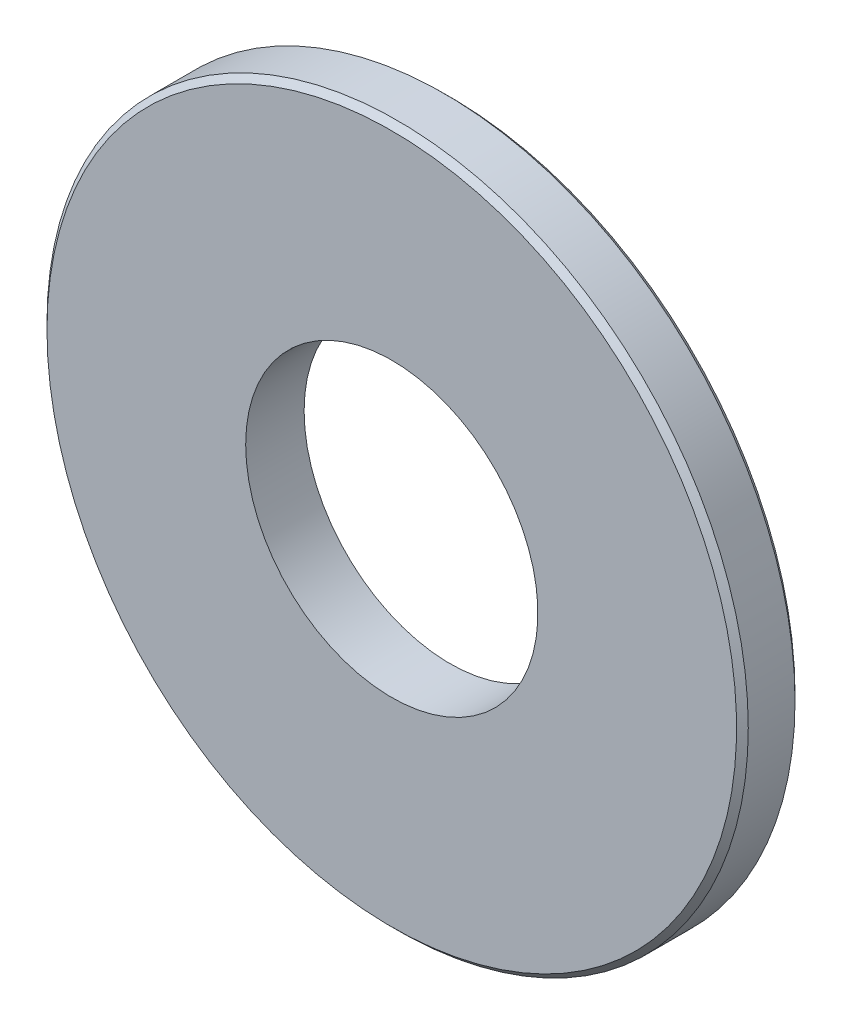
from build123d import *

# Parameters (mm, degrees)
ESQUISSE1_R          = 6
ESQUISSE1_R_2        = 2.5
BASE_EXTRUSION_DEPTH = 1
CHANFREIN1_SIZE      = 0.1


with BuildPart() as part:
    # Esquisse1 → Base-Extrusion (new body)
    with BuildSketch(Plane.XY):
        with Locations(Location((0, 0, 0), (0, 0, 180))):
            Circle(ESQUISSE1_R)
        with Locations(Location((0, 0, 0), (0, 0, 180))):
            Circle(ESQUISSE1_R_2, mode=Mode.SUBTRACT)
    extrude(amount=BASE_EXTRUSION_DEPTH)

    # Chanfrein1
    chanfrein1_edges = [part.edges().sort_by_distance(p)[0] for p in [
        (6, 0, 0),
        (6, 0, 1),
    ]]
    chamfer(chanfrein1_edges, length=CHANFREIN1_SIZE)


solid = part.part
